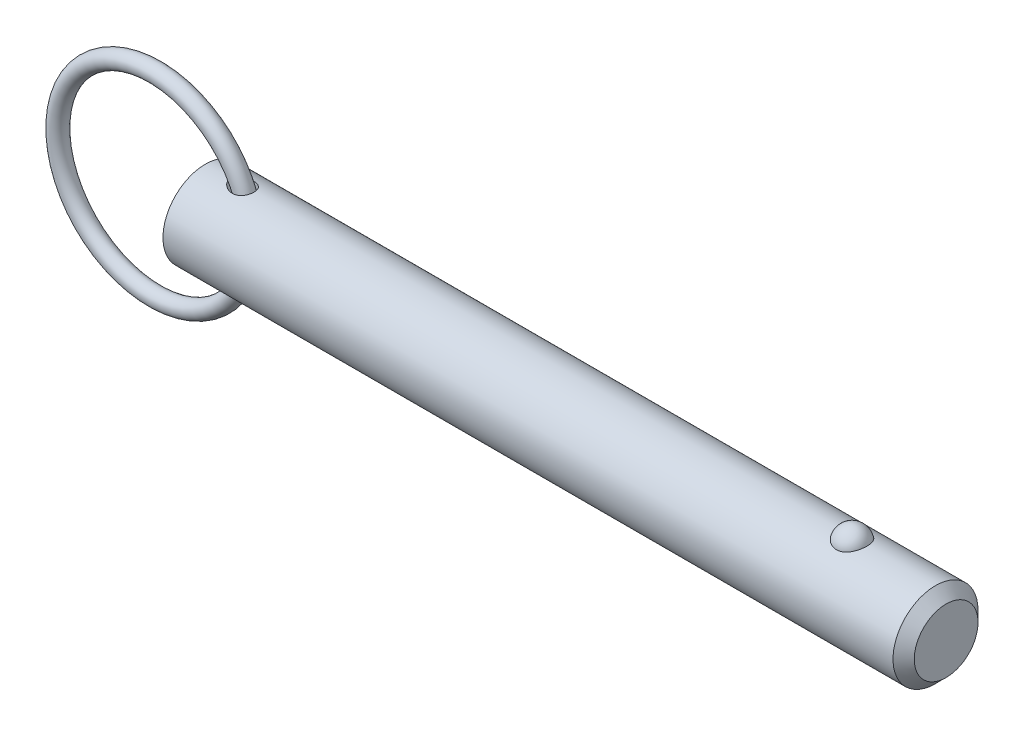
ISO-10303-21;
HEADER;
FILE_DESCRIPTION(('STEP AP214'),'2;1');
FILE_NAME('part.step','',(''),(''),'','','');
FILE_SCHEMA(('AUTOMOTIVE_DESIGN { 1 0 10303 214 1 1 1 1 }'));
ENDSEC;
DATA;
#1=APPLICATION_CONTEXT('core data for automotive mechanical design processes');
#2=APPLICATION_PROTOCOL_DEFINITION('international standard','automotive_design',2000,#1);
#3=PRODUCT_CONTEXT('',#1,'mechanical');
#4=PRODUCT('Part','Part','',(#3));
#5=PRODUCT_RELATED_PRODUCT_CATEGORY('part','',(#4));
#6=PRODUCT_DEFINITION_FORMATION('','',#4);
#7=PRODUCT_DEFINITION_CONTEXT('part definition',#1,'design');
#8=PRODUCT_DEFINITION('design','',#6,#7);
#9=PRODUCT_DEFINITION_SHAPE('','',#8);
#10=(LENGTH_UNIT() NAMED_UNIT(*) SI_UNIT(.MILLI.,.METRE.));
#11=(NAMED_UNIT(*) PLANE_ANGLE_UNIT() SI_UNIT($,.RADIAN.));
#12=(NAMED_UNIT(*) SI_UNIT($,.STERADIAN.) SOLID_ANGLE_UNIT());
#13=UNCERTAINTY_MEASURE_WITH_UNIT(LENGTH_MEASURE(1.E-05),#10,'distance_accuracy_value','');
#14=(GEOMETRIC_REPRESENTATION_CONTEXT(3) GLOBAL_UNCERTAINTY_ASSIGNED_CONTEXT((#13)) GLOBAL_UNIT_ASSIGNED_CONTEXT((#10,
#11,#12)) REPRESENTATION_CONTEXT('',''));
#15=CARTESIAN_POINT('',(0.,0.,0.));
#16=DIRECTION('',(0.,0.,1.));
#17=DIRECTION('',(1.,0.,0.));
#18=AXIS2_PLACEMENT_3D('',#15,#16,#17);
#19=CARTESIAN_POINT('',(-6.5973878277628,0.,0.));
#20=DIRECTION('',(0.,0.,1.));
#21=DIRECTION('',(1.,0.,0.));
#22=AXIS2_PLACEMENT_3D('',#19,#20,#21);
#23=TOROIDAL_SURFACE('',#22,12.7,1.111);
#24=CARTESIAN_POINT('',(7.21361217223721,0.,0.));
#25=VERTEX_POINT('',#24);
#26=VERTEX_LOOP('',#25);
#27=FACE_BOUND('',#26,.T.);
#28=ADVANCED_FACE('P0_F12',(#27),#23,.T.);
#29=CLOSED_SHELL('',(#28));
#30=MANIFOLD_SOLID_BREP('P0_B1',#29);
#31=CARTESIAN_POINT('',(0.,0.,0.));
#32=DIRECTION('',(1.,0.,0.));
#33=DIRECTION('',(0.,0.,-1.));
#34=AXIS2_PLACEMENT_3D('',#31,#32,#33);
#35=CYLINDRICAL_SURFACE('',#34,5.555);
#36=CARTESIAN_POINT('',(3.4079629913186,5.52646850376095,-0.56229074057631));
#37=CARTESIAN_POINT('',(3.45038002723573,5.51879026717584,-0.637753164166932));
#38=CARTESIAN_POINT('',(3.50032814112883,5.50998541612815,-0.70889136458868));
#39=CARTESIAN_POINT('',(3.61174203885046,5.49132550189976,-0.841353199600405));
#40=CARTESIAN_POINT('',(3.67323300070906,5.48146816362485,-0.902654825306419));
#41=CARTESIAN_POINT('',(3.80437942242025,5.46186986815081,-1.01449227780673));
#42=CARTESIAN_POINT('',(3.87396236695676,5.45212862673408,-1.06511378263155));
#43=CARTESIAN_POINT('',(4.01965973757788,5.43359578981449,-1.15594541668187));
#44=CARTESIAN_POINT('',(4.09577226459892,5.42480391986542,-1.19615855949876));
#45=CARTESIAN_POINT('',(4.26620236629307,5.40764958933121,-1.27165209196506));
#46=CARTESIAN_POINT('',(4.36143030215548,5.3996073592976,-1.30496908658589));
#47=CARTESIAN_POINT('',(4.55632904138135,5.38707461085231,-1.35578120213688));
#48=CARTESIAN_POINT('',(4.65600230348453,5.38258608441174,-1.37326745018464));
#49=CARTESIAN_POINT('',(4.85802759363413,5.37803111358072,-1.3910078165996));
#50=CARTESIAN_POINT('',(4.96039620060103,5.37800782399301,-1.39109376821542));
#51=CARTESIAN_POINT('',(5.16321961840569,5.38288845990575,-1.37209481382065));
#52=CARTESIAN_POINT('',(5.26367660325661,5.38778639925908,-1.3530331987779));
#53=CARTESIAN_POINT('',(5.44616808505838,5.40112654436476,-1.29866014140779));
#54=CARTESIAN_POINT('',(5.52893514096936,5.40904875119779,-1.26567968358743));
#55=CARTESIAN_POINT('',(5.68656142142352,5.4273273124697,-1.18484144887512));
#56=CARTESIAN_POINT('',(5.76142575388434,5.43768208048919,-1.13699336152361));
#57=CARTESIAN_POINT('',(5.8928378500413,5.45821422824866,-1.03362464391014));
#58=CARTESIAN_POINT('',(5.95048930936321,5.4682911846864,-0.979480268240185));
#59=CARTESIAN_POINT('',(6.05543937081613,5.48805232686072,-0.861887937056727));
#60=CARTESIAN_POINT('',(6.10274018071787,5.4977365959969,-0.798441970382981));
#61=CARTESIAN_POINT('',(6.18429732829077,5.51527779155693,-0.666351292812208));
#62=CARTESIAN_POINT('',(6.21893047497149,5.52318421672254,-0.597945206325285));
#63=CARTESIAN_POINT('',(6.27643902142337,5.53669785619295,-0.456146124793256));
#64=CARTESIAN_POINT('',(6.299314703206,5.54230512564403,-0.382753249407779));
#65=CARTESIAN_POINT('',(6.33280284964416,5.55061821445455,-0.232999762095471));
#66=CARTESIAN_POINT('',(6.34340498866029,5.55332159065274,-0.156636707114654));
#67=CARTESIAN_POINT('',(6.35208224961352,5.55552923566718,-0.00315477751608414));
#68=CARTESIAN_POINT('',(6.3501570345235,5.55503341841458,0.0739641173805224));
#69=CARTESIAN_POINT('',(6.33379320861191,5.55088854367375,0.22702996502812));
#70=CARTESIAN_POINT('',(6.31931424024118,5.54722931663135,0.302972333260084));
#71=CARTESIAN_POINT('',(6.27810810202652,5.53713917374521,0.451265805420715));
#72=CARTESIAN_POINT('',(6.25138106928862,5.53070828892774,0.523616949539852));
#73=CARTESIAN_POINT('',(6.18634700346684,5.51578851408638,0.662556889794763));
#74=CARTESIAN_POINT('',(6.14805666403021,5.50730259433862,0.729153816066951));
#75=CARTESIAN_POINT('',(6.0608417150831,5.4892059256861,0.854797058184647));
#76=CARTESIAN_POINT('',(6.01191805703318,5.47959527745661,0.91384404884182));
#77=CARTESIAN_POINT('',(5.90496974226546,5.46035411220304,1.0225462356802));
#78=CARTESIAN_POINT('',(5.8469816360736,5.45072382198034,1.07223745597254));
#79=CARTESIAN_POINT('',(5.72342907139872,5.43245016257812,1.16128533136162));
#80=CARTESIAN_POINT('',(5.65786492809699,5.42380675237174,1.20064241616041));
#81=CARTESIAN_POINT('',(5.52033184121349,5.40830592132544,1.26865612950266));
#82=CARTESIAN_POINT('',(5.44830127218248,5.40146883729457,1.29719236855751));
#83=CARTESIAN_POINT('',(5.30051649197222,5.39032432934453,1.34275086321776));
#84=CARTESIAN_POINT('',(5.22476137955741,5.38601752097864,1.35977031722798));
#85=CARTESIAN_POINT('',(5.06697568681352,5.38004503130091,1.3832203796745));
#86=CARTESIAN_POINT('',(4.98483834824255,5.37854992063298,1.38896799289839));
#87=CARTESIAN_POINT('',(4.82062075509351,5.37866467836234,1.38851901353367));
#88=CARTESIAN_POINT('',(4.73854053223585,5.38027567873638,1.38231806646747));
#89=CARTESIAN_POINT('',(4.5665970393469,5.38661928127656,1.35740374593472));
#90=CARTESIAN_POINT('',(4.47694676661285,5.39169506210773,1.33731128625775));
#91=CARTESIAN_POINT('',(4.30168169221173,5.40457769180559,1.28425210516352));
#92=CARTESIAN_POINT('',(4.2160714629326,5.41238755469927,1.25127117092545));
#93=CARTESIAN_POINT('',(4.04117722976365,5.43085841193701,1.16867508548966));
#94=CARTESIAN_POINT('',(3.95261220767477,5.44174460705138,1.11757796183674));
#95=CARTESIAN_POINT('',(3.78568183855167,5.46440376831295,1.00091858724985));
#96=CARTESIAN_POINT('',(3.70730710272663,5.47617590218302,0.935369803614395));
#97=CARTESIAN_POINT('',(3.5829937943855,5.49603821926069,0.809043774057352));
#98=CARTESIAN_POINT('',(3.5339020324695,5.50429522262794,0.751392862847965));
#99=CARTESIAN_POINT('',(3.44556991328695,5.51963490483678,0.628847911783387));
#100=CARTESIAN_POINT('',(3.40631385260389,5.52671944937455,0.563965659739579));
#101=CARTESIAN_POINT('',(3.34553998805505,5.5379053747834,0.439181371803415));
#102=CARTESIAN_POINT('',(3.32216705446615,5.5423057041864,0.380214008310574));
#103=CARTESIAN_POINT('',(3.2854368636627,5.54928356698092,0.259119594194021));
#104=CARTESIAN_POINT('',(3.27207322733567,5.5518622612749,0.196994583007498));
#105=CARTESIAN_POINT('',(3.25633559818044,5.5549036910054,0.0710541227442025));
#106=CARTESIAN_POINT('',(3.25400356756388,5.5553583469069,0.00723314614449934));
#107=CARTESIAN_POINT('',(3.26064251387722,5.55407150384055,-0.119787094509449));
#108=CARTESIAN_POINT('',(3.26961302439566,5.55233009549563,-0.182986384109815));
#109=CARTESIAN_POINT('',(3.29666795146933,5.54714559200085,-0.30051820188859));
#110=CARTESIAN_POINT('',(3.31373453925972,5.54389322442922,-0.355099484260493));
#111=CARTESIAN_POINT('',(3.35543396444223,5.53607951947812,-0.461174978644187));
#112=CARTESIAN_POINT('',(3.38007019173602,5.5315175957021,-0.512667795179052));
#113=CARTESIAN_POINT('',(3.4079629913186,5.52646850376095,-0.56229074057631));
#114=B_SPLINE_CURVE_WITH_KNOTS('',3,(#36,#37,#38,#39,#40,#41,#42,#43,#44,#45,#46,#47,#48,#49,
#50,#51,#52,#53,#54,#55,#56,#57,#58,#59,#60,#61,#62,#63,#64,#65,#66,#67,#68,#69,#70,#71,#72,#73,
#74,#75,#76,#77,#78,#79,#80,#81,#82,#83,#84,#85,#86,#87,#88,#89,#90,#91,#92,#93,#94,#95,#96,#97,
#98,#99,#100,#101,#102,#103,#104,#105,#106,#107,#108,#109,#110,#111,#112,#113),.UNSPECIFIED.,
.T.,.F.,(4,2,2,2,2,2,2,2,2,2,2,2,2,2,2,2,2,2,2,2,2,2,2,2,2,2,2,2,2,2,2,2,2,2,2,2,2,2,4),(0.,
0.260459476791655,0.521493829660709,0.780346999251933,1.03912513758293,1.34137402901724,
1.64379222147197,1.94913302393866,2.25410286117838,2.52092363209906,2.78757087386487,
3.0255756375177,3.26352958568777,3.49368251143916,3.72382991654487,3.9541708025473,
4.18451788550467,4.41560824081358,4.64669600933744,4.87745174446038,5.10818684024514,
5.33801446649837,5.56783253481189,5.80013729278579,6.03249854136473,6.27855081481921,
6.5246927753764,6.79963372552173,7.07487872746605,7.38193573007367,7.68870779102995,
7.91639390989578,8.14371416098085,8.33366541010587,8.52349549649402,8.71404708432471,
8.90459080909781,9.07578823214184,9.24706243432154),.UNSPECIFIED.);
#115=CARTESIAN_POINT('',(3.4079629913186,5.52646850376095,-0.56229074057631));
#116=VERTEX_POINT('',#115);
#117=EDGE_CURVE('P1_E40',#116,#116,#114,.T.);
#118=ORIENTED_EDGE('',*,*,#117,.T.);
#119=EDGE_LOOP('',(#118));
#120=FACE_BOUND('',#119,.T.);
#121=CARTESIAN_POINT('',(95.43125,0.,0.));
#122=DIRECTION('',(1.,0.,0.));
#123=DIRECTION('',(0.,0.,-1.));
#124=AXIS2_PLACEMENT_3D('',#121,#122,#123);
#125=CIRCLE('',#124,5.555);
#126=CARTESIAN_POINT('',(95.43125,0.,-5.555));
#127=VERTEX_POINT('',#126);
#128=EDGE_CURVE('P1_E25',#127,#127,#125,.T.);
#129=ORIENTED_EDGE('',*,*,#128,.F.);
#130=EDGE_LOOP('',(#129));
#131=FACE_BOUND('',#130,.T.);
#132=CARTESIAN_POINT('',(0.,0.,0.));
#133=DIRECTION('',(1.,0.,0.));
#134=DIRECTION('',(0.,0.,-1.));
#135=AXIS2_PLACEMENT_3D('',#132,#133,#134);
#136=CIRCLE('',#135,5.555);
#137=CARTESIAN_POINT('',(0.,0.,-5.555));
#138=VERTEX_POINT('',#137);
#139=EDGE_CURVE('P1_E9',#138,#138,#136,.T.);
#140=ORIENTED_EDGE('',*,*,#139,.T.);
#141=EDGE_LOOP('',(#140));
#142=FACE_BOUND('',#141,.T.);
#143=CARTESIAN_POINT('',(84.5186264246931,5.16741224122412,2.03859650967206));
#144=CARTESIAN_POINT('',(84.4129492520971,5.16740893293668,2.03859990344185));
#145=CARTESIAN_POINT('',(84.3072989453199,5.17079470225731,2.03008306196));
#146=CARTESIAN_POINT('',(84.0991419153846,5.18392795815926,1.99630721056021));
#147=CARTESIAN_POINT('',(83.9966344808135,5.19367399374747,1.97105201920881));
#148=CARTESIAN_POINT('',(83.7977710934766,5.21839168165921,1.90463997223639));
#149=CARTESIAN_POINT('',(83.7014064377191,5.23335573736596,1.86350622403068));
#150=CARTESIAN_POINT('',(83.5170804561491,5.26688076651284,1.76652592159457));
#151=CARTESIAN_POINT('',(83.4291207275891,5.28544242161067,1.71067657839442));
#152=CARTESIAN_POINT('',(83.261265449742,5.32479845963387,1.58399959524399));
#153=CARTESIAN_POINT('',(83.1816656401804,5.34564089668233,1.51279545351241));
#154=CARTESIAN_POINT('',(83.0351290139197,5.38697258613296,1.35828584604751));
#155=CARTESIAN_POINT('',(82.968194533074,5.40746177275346,1.27497815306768));
#156=CARTESIAN_POINT('',(82.8456103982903,5.44694508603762,1.09440293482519));
#157=CARTESIAN_POINT('',(82.7905989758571,5.46583143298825,0.996677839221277));
#158=CARTESIAN_POINT('',(82.6969376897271,5.49908030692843,0.79296193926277));
#159=CARTESIAN_POINT('',(82.6582894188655,5.513442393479,0.686970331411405));
#160=CARTESIAN_POINT('',(82.5976807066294,5.536358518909,0.468019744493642));
#161=CARTESIAN_POINT('',(82.5759725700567,5.54482455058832,0.354981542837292));
#162=CARTESIAN_POINT('',(82.5506362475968,5.55473324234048,0.126595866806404));
#163=CARTESIAN_POINT('',(82.5470077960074,5.55617600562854,0.0112484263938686));
#164=CARTESIAN_POINT('',(82.5578817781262,5.55189984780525,-0.218011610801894));
#165=CARTESIAN_POINT('',(82.5723151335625,5.54620821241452,-0.331928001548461));
#166=CARTESIAN_POINT('',(82.618903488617,5.52828920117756,-0.555544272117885));
#167=CARTESIAN_POINT('',(82.6510588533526,5.5160616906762,-0.66524406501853));
#168=CARTESIAN_POINT('',(82.7324883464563,5.48630779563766,-0.877469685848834));
#169=CARTESIAN_POINT('',(82.781781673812,5.4687754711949,-0.979987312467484));
#170=CARTESIAN_POINT('',(82.8964785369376,5.43024700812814,-1.17486975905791));
#171=CARTESIAN_POINT('',(82.9618831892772,5.4092506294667,-1.26723387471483));
#172=CARTESIAN_POINT('',(83.1075712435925,5.36600927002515,-1.43940133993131));
#173=CARTESIAN_POINT('',(83.1878859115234,5.34376173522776,-1.51917763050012));
#174=CARTESIAN_POINT('',(83.3614520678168,5.30057971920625,-1.66360338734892));
#175=CARTESIAN_POINT('',(83.454702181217,5.27964509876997,-1.72825445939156));
#176=CARTESIAN_POINT('',(83.6493939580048,5.24205250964,-1.83909478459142));
#177=CARTESIAN_POINT('',(83.7505900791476,5.22530519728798,-1.88568407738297));
#178=CARTESIAN_POINT('',(83.9601552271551,5.19750919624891,-1.96100802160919));
#179=CARTESIAN_POINT('',(84.0685215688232,5.1864583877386,-1.98974931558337));
#180=CARTESIAN_POINT('',(84.2834989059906,5.17184410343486,-2.02742262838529));
#181=CARTESIAN_POINT('',(84.389925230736,5.1679328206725,-2.03727608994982));
#182=CARTESIAN_POINT('',(84.6029925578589,5.16698995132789,-2.03966777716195));
#183=CARTESIAN_POINT('',(84.7096335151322,5.16995704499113,-2.03220932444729));
#184=CARTESIAN_POINT('',(84.9167730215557,5.18222383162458,-2.00071170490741));
#185=CARTESIAN_POINT('',(85.0173599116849,5.19133213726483,-1.97717337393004));
#186=CARTESIAN_POINT('',(85.2130141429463,5.21467637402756,-1.91475248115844));
#187=CARTESIAN_POINT('',(85.3080810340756,5.22891272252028,-1.87586867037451));
#188=CARTESIAN_POINT('',(85.4923711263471,5.26137066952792,-1.7828271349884));
#189=CARTESIAN_POINT('',(85.5814190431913,5.27967329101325,-1.72835124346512));
#190=CARTESIAN_POINT('',(85.7492880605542,5.31817411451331,-1.6059748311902));
#191=CARTESIAN_POINT('',(85.8281068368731,5.33837274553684,-1.53807126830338));
#192=CARTESIAN_POINT('',(85.9775156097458,5.37968287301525,-1.38688970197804));
#193=CARTESIAN_POINT('',(86.0475058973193,5.40079011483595,-1.30301744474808));
#194=CARTESIAN_POINT('',(86.1730125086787,5.44074401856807,-1.12458170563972));
#195=CARTESIAN_POINT('',(86.2285262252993,5.4595902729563,-1.03001630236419));
#196=CARTESIAN_POINT('',(86.3255507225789,5.49369849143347,-0.829439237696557));
#197=CARTESIAN_POINT('',(86.3665483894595,5.50882422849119,-0.723155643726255));
#198=CARTESIAN_POINT('',(86.4311250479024,5.53310911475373,-0.504772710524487));
#199=CARTESIAN_POINT('',(86.4547036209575,5.54226812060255,-0.392673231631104));
#200=CARTESIAN_POINT('',(86.484013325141,5.55370358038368,-0.165459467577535));
#201=CARTESIAN_POINT('',(86.4896884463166,5.55595843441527,-0.0503368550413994));
#202=CARTESIAN_POINT('',(86.482916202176,5.55329317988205,0.179288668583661));
#203=CARTESIAN_POINT('',(86.4704690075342,5.54837313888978,0.29379158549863));
#204=CARTESIAN_POINT('',(86.4277798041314,5.53189037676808,0.51852641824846));
#205=CARTESIAN_POINT('',(86.397598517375,5.5203503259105,0.628771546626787));
#206=CARTESIAN_POINT('',(86.3200962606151,5.49182453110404,0.842318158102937));
#207=CARTESIAN_POINT('',(86.2727743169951,5.47483847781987,0.945619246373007));
#208=CARTESIAN_POINT('',(86.1617204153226,5.43710633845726,1.14281571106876));
#209=CARTESIAN_POINT('',(86.0979215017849,5.41634501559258,1.23667048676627));
#210=CARTESIAN_POINT('',(85.9553577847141,5.37334572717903,1.41185243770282));
#211=CARTESIAN_POINT('',(85.8765932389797,5.35110778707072,1.4931798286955));
#212=CARTESIAN_POINT('',(85.7064234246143,5.30779474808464,1.64049162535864));
#213=CARTESIAN_POINT('',(85.6151002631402,5.28671324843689,1.70656877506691));
#214=CARTESIAN_POINT('',(85.4217390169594,5.24804852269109,1.82201372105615));
#215=CARTESIAN_POINT('',(85.3197005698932,5.23046541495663,1.87138095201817));
#216=CARTESIAN_POINT('',(85.1036187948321,5.20042692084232,1.95335298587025));
#217=CARTESIAN_POINT('',(84.989260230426,5.18820192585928,1.98521734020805));
#218=CARTESIAN_POINT('',(84.7561307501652,5.17169804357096,2.02783294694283));
#219=CARTESIAN_POINT('',(84.6373616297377,5.16741595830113,2.03859269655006));
#220=CARTESIAN_POINT('',(84.5186264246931,5.16741224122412,2.03859650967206));
#221=B_SPLINE_CURVE_WITH_KNOTS('',3,(#143,#144,#145,#146,#147,#148,#149,#150,#151,#152,#153,
#154,#155,#156,#157,#158,#159,#160,#161,#162,#163,#164,#165,#166,#167,#168,#169,#170,#171,#172,
#173,#174,#175,#176,#177,#178,#179,#180,#181,#182,#183,#184,#185,#186,#187,#188,#189,#190,#191,
#192,#193,#194,#195,#196,#197,#198,#199,#200,#201,#202,#203,#204,#205,#206,#207,#208,#209,#210,
#211,#212,#213,#214,#215,#216,#217,#218,#219,#220),.UNSPECIFIED.,.T.,.F.,(4,2,2,2,2,2,2,2,2,2,2,
2,2,2,2,2,2,2,2,2,2,2,2,2,2,2,2,2,2,2,2,2,2,2,2,2,2,2,4),(0.,0.316595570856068,
0.633118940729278,0.949183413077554,1.26530783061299,1.59030762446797,1.91536729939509,
2.25495824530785,2.59458224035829,2.93917283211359,3.28375835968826,3.62703002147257,
3.97030875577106,4.31397329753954,4.65766166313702,5.0020790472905,5.34645984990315,
5.68270547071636,6.01882587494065,6.33808403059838,6.65728093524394,6.96696376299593,
7.27667180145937,7.59321535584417,7.909830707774,8.24210387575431,8.57443684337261,
8.91755896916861,9.26068933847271,9.60489211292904,9.94909164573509,10.2921194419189,
10.6351667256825,10.9796305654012,11.3240884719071,11.6663928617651,12.0087088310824,
12.3645679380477,12.7202837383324),.UNSPECIFIED.);
#222=CARTESIAN_POINT('',(84.5186264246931,5.16741224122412,2.03859650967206));
#223=VERTEX_POINT('',#222);
#224=EDGE_CURVE('P1_E34',#223,#223,#221,.T.);
#225=ORIENTED_EDGE('',*,*,#224,.T.);
#226=EDGE_LOOP('',(#225));
#227=FACE_BOUND('',#226,.T.);
#228=CARTESIAN_POINT('',(3.4079629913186,-5.52646850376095,-0.56229074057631));
#229=CARTESIAN_POINT('',(3.37716927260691,-5.53204268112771,-0.507507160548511));
#230=CARTESIAN_POINT('',(3.35034276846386,-5.53702335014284,-0.450440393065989));
#231=CARTESIAN_POINT('',(3.30606625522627,-5.54534377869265,-0.3326552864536));
#232=CARTESIAN_POINT('',(3.28860803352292,-5.5486849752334,-0.271940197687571));
#233=CARTESIAN_POINT('',(3.26421203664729,-5.55337514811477,-0.148013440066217));
#234=CARTESIAN_POINT('',(3.25732647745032,-5.55471423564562,-0.0847909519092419));
#235=CARTESIAN_POINT('',(3.25480623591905,-5.5552029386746,0.0418913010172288));
#236=CARTESIAN_POINT('',(3.25917102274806,-5.55435265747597,0.105351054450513));
#237=CARTESIAN_POINT('',(3.27824306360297,-5.55067444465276,0.227039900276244));
#238=CARTESIAN_POINT('',(3.29237198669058,-5.54795714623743,0.285365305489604));
#239=CARTESIAN_POINT('',(3.32941044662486,-5.54094262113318,0.399033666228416));
#240=CARTESIAN_POINT('',(3.3523223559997,-5.53664496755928,0.454375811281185));
#241=CARTESIAN_POINT('',(3.40768868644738,-5.52648234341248,0.56509977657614));
#242=CARTESIAN_POINT('',(3.44072521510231,-5.52052470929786,0.620179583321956));
#243=CARTESIAN_POINT('',(3.51400705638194,-5.50771567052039,0.725188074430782));
#244=CARTESIAN_POINT('',(3.55425830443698,-5.50086353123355,0.775112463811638));
#245=CARTESIAN_POINT('',(3.66122818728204,-5.48337209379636,0.891977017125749));
#246=CARTESIAN_POINT('',(3.73142715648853,-5.47248221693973,0.955709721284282));
#247=CARTESIAN_POINT('',(3.88137100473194,-5.45112279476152,1.07085228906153));
#248=CARTESIAN_POINT('',(3.96113047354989,-5.44065392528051,1.12224294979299));
#249=CARTESIAN_POINT('',(4.12858826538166,-5.42121387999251,1.21269344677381));
#250=CARTESIAN_POINT('',(4.21635930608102,-5.41225908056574,1.25162207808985));
#251=CARTESIAN_POINT('',(4.39702156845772,-5.39704895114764,1.31566440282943));
#252=CARTESIAN_POINT('',(4.48991226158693,-5.39079334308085,1.34077951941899));
#253=CARTESIAN_POINT('',(4.68604255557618,-5.38154547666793,1.37745897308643));
#254=CARTESIAN_POINT('',(4.78952677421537,-5.37884317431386,1.38782444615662));
#255=CARTESIAN_POINT('',(4.9967070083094,-5.3783992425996,1.38955482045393));
#256=CARTESIAN_POINT('',(5.10040282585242,-5.380654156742,1.380932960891));
#257=CARTESIAN_POINT('',(5.29344112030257,-5.3896561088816,1.34533259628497));
#258=CARTESIAN_POINT('',(5.38316618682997,-5.39591960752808,1.32032381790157));
#259=CARTESIAN_POINT('',(5.55593681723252,-5.41176992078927,1.25376768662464));
#260=CARTESIAN_POINT('',(5.63898852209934,-5.42135363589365,1.2122357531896));
#261=CARTESIAN_POINT('',(5.78518175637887,-5.4411584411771,1.1197110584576));
#262=CARTESIAN_POINT('',(5.84951468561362,-5.45115126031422,1.07054233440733));
#263=CARTESIAN_POINT('',(5.96832363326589,-5.47143247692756,0.961516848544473));
#264=CARTESIAN_POINT('',(6.02280238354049,-5.48172079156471,0.901663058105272));
#265=CARTESIAN_POINT('',(6.11773365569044,-5.50082367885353,0.776380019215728));
#266=CARTESIAN_POINT('',(6.15876077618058,-5.50968670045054,0.711392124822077));
#267=CARTESIAN_POINT('',(6.22940016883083,-5.52555592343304,0.575278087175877));
#268=CARTESIAN_POINT('',(6.25901321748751,-5.53256225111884,0.504152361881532));
#269=CARTESIAN_POINT('',(6.30603044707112,-5.54392803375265,0.358090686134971));
#270=CARTESIAN_POINT('',(6.32348246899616,-5.54829785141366,0.283170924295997));
#271=CARTESIAN_POINT('',(6.34598368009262,-5.5539654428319,0.131376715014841));
#272=CARTESIAN_POINT('',(6.35103253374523,-5.55526313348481,0.054502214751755));
#273=CARTESIAN_POINT('',(6.34861245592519,-5.55464639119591,-0.0993401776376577));
#274=CARTESIAN_POINT('',(6.34109421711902,-5.5527193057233,-0.176307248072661));
#275=CARTESIAN_POINT('',(6.31360904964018,-5.54583593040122,-0.327847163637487));
#276=CARTESIAN_POINT('',(6.29364207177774,-5.54087962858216,-0.402419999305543));
#277=CARTESIAN_POINT('',(6.24170966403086,-5.52847553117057,-0.547041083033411));
#278=CARTESIAN_POINT('',(6.20974488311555,-5.52102787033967,-0.617089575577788));
#279=CARTESIAN_POINT('',(6.13458425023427,-5.5044595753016,-0.750655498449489));
#280=CARTESIAN_POINT('',(6.09138916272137,-5.49533905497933,-0.814173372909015));
#281=CARTESIAN_POINT('',(5.99508306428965,-5.47647644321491,-0.932642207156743));
#282=CARTESIAN_POINT('',(5.94201288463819,-5.46673701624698,-0.987626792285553));
#283=CARTESIAN_POINT('',(5.82732079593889,-5.4476756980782,-1.08787197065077));
#284=CARTESIAN_POINT('',(5.76569959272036,-5.43835377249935,-1.133133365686));
#285=CARTESIAN_POINT('',(5.63545565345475,-5.42108746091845,-1.2130627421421));
#286=CARTESIAN_POINT('',(5.56680798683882,-5.41314827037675,-1.24769112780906));
#287=CARTESIAN_POINT('',(5.42470366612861,-5.39946749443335,-1.30562834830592));
#288=CARTESIAN_POINT('',(5.35124627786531,-5.39372624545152,-1.32893545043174));
#289=CARTESIAN_POINT('',(5.19834649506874,-5.38471871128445,-1.36498831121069));
#290=CARTESIAN_POINT('',(5.11878242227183,-5.38156800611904,-1.37724301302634));
#291=CARTESIAN_POINT('',(4.95867408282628,-5.37830368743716,-1.38993264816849));
#292=CARTESIAN_POINT('',(4.87812945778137,-5.37819121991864,-1.39036312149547));
#293=CARTESIAN_POINT('',(4.70952450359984,-5.38096665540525,-1.37958681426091));
#294=CARTESIAN_POINT('',(4.62154757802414,-5.38416579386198,-1.36717293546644));
#295=CARTESIAN_POINT('',(4.44844201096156,-5.39350862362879,-1.32983172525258));
#296=CARTESIAN_POINT('',(4.36331534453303,-5.39965431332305,-1.30489590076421));
#297=CARTESIAN_POINT('',(4.18705584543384,-5.41508127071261,-1.23943340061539));
#298=CARTESIAN_POINT('',(4.09653169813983,-5.42466147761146,-1.19732979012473));
#299=CARTESIAN_POINT('',(3.92355621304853,-5.44542654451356,-1.09903394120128));
#300=CARTESIAN_POINT('',(3.84111059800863,-5.45661252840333,-1.04283181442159));
#301=CARTESIAN_POINT('',(3.69303712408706,-5.47835672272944,-0.921492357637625));
#302=CARTESIAN_POINT('',(3.62661543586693,-5.4888999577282,-0.857326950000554));
#303=CARTESIAN_POINT('',(3.50663841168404,-5.50887375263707,-0.717815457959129));
#304=CARTESIAN_POINT('',(3.45304856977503,-5.51830726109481,-0.642500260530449));
#305=CARTESIAN_POINT('',(3.4079629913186,-5.52646850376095,-0.56229074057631));
#306=B_SPLINE_CURVE_WITH_KNOTS('',3,(#228,#229,#230,#231,#232,#233,#234,#235,#236,#237,#238,
#239,#240,#241,#242,#243,#244,#245,#246,#247,#248,#249,#250,#251,#252,#253,#254,#255,#256,#257,
#258,#259,#260,#261,#262,#263,#264,#265,#266,#267,#268,#269,#270,#271,#272,#273,#274,#275,#276,
#277,#278,#279,#280,#281,#282,#283,#284,#285,#286,#287,#288,#289,#290,#291,#292,#293,#294,#295,
#296,#297,#298,#299,#300,#301,#302,#303,#304,#305),.UNSPECIFIED.,.T.,.F.,(4,2,2,2,2,2,2,2,2,2,2,
2,2,2,2,2,2,2,2,2,2,2,2,2,2,2,2,2,2,2,2,2,2,2,2,2,2,2,4),(0.,0.189054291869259,
0.377942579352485,0.567760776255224,0.757570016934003,0.937004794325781,1.11648807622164,
1.30929480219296,1.50226088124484,1.78704908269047,2.07227755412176,2.3604171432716,
2.64852704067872,2.95892962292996,3.26911584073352,3.5475451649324,3.82571526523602,
4.06921935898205,4.31265584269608,4.54364944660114,4.77462733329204,5.00469135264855,
5.23476159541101,5.46573664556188,5.69671260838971,5.92767607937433,6.15862383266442,
6.38863707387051,6.61863134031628,6.84947196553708,7.08034790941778,7.32103794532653,
7.56181876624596,7.82747997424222,8.09332161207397,8.39289891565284,8.69268692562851,
8.97023931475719,9.24703674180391),.UNSPECIFIED.);
#307=CARTESIAN_POINT('',(3.4079629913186,-5.52646850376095,-0.56229074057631));
#308=VERTEX_POINT('',#307);
#309=EDGE_CURVE('P1_E17',#308,#308,#306,.T.);
#310=ORIENTED_EDGE('',*,*,#309,.T.);
#311=EDGE_LOOP('',(#310));
#312=FACE_BOUND('',#311,.T.);
#313=ADVANCED_FACE('P1_F13',(#120,#131,#142,#227,#312),#35,.T.);
#314=CARTESIAN_POINT('',(0.,0.,0.));
#315=DIRECTION('',(-1.,0.,0.));
#316=DIRECTION('',(0.,0.,1.));
#317=AXIS2_PLACEMENT_3D('',#314,#315,#316);
#318=PLANE('',#317);
#319=ORIENTED_EDGE('',*,*,#139,.F.);
#320=EDGE_LOOP('',(#319));
#321=FACE_BOUND('',#320,.T.);
#322=ADVANCED_FACE('P1_F15',(#321),#318,.T.);
#323=CARTESIAN_POINT('',(96.82,0.,0.));
#324=DIRECTION('',(-1.,0.,0.));
#325=DIRECTION('',(0.,0.,1.));
#326=AXIS2_PLACEMENT_3D('',#323,#324,#325);
#327=CONICAL_SURFACE('',#326,4.16625000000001,0.785398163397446);
#328=ORIENTED_EDGE('',*,*,#128,.T.);
#329=EDGE_LOOP('',(#328));
#330=FACE_BOUND('',#329,.T.);
#331=CARTESIAN_POINT('',(96.82,0.,0.));
#332=DIRECTION('',(1.,0.,0.));
#333=DIRECTION('',(0.,0.,-1.));
#334=AXIS2_PLACEMENT_3D('',#331,#332,#333);
#335=CIRCLE('',#334,4.16625000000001);
#336=CARTESIAN_POINT('',(96.82,0.,-4.16625000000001));
#337=VERTEX_POINT('',#336);
#338=EDGE_CURVE('P1_E30',#337,#337,#335,.T.);
#339=ORIENTED_EDGE('',*,*,#338,.F.);
#340=EDGE_LOOP('',(#339));
#341=FACE_BOUND('',#340,.T.);
#342=ADVANCED_FACE('P1_F55',(#330,#341),#327,.T.);
#343=CARTESIAN_POINT('',(96.82,4.16625000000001,0.));
#344=DIRECTION('',(1.,0.,0.));
#345=DIRECTION('',(0.,0.,-1.));
#346=AXIS2_PLACEMENT_3D('',#343,#344,#345);
#347=PLANE('',#346);
#348=ORIENTED_EDGE('',*,*,#338,.T.);
#349=EDGE_LOOP('',(#348));
#350=FACE_BOUND('',#349,.T.);
#351=ADVANCED_FACE('P1_F51',(#350),#347,.T.);
#352=CARTESIAN_POINT('',(84.5186264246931,4.9995,0.));
#353=DIRECTION('',(-1.,0.,0.));
#354=DIRECTION('',(0.,1.,0.));
#355=AXIS2_PLACEMENT_3D('',#352,#353,#354);
#356=SPHERICAL_SURFACE('',#355,2.04550000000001);
#357=ORIENTED_EDGE('',*,*,#224,.F.);
#358=EDGE_LOOP('',(#357));
#359=FACE_BOUND('',#358,.T.);
#360=ADVANCED_FACE('P1_F46',(#359),#356,.T.);
#361=CARTESIAN_POINT('',(-6.59738782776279,0.,0.));
#362=DIRECTION('',(0.,0.,1.));
#363=DIRECTION('',(1.,0.,0.));
#364=AXIS2_PLACEMENT_3D('',#361,#362,#363);
#365=TOROIDAL_SURFACE('',#364,12.7,1.38875);
#366=ORIENTED_EDGE('',*,*,#309,.F.);
#367=EDGE_LOOP('',(#366));
#368=FACE_BOUND('',#367,.T.);
#369=ORIENTED_EDGE('',*,*,#117,.F.);
#370=EDGE_LOOP('',(#369));
#371=FACE_BOUND('',#370,.T.);
#372=ADVANCED_FACE('P1_F50',(#368,#371),#365,.F.);
#373=CLOSED_SHELL('',(#313,#322,#342,#351,#360,#372));
#374=MANIFOLD_SOLID_BREP('P1_B1',#373);
#375=ADVANCED_BREP_SHAPE_REPRESENTATION('',(#18,#30,#374),#14);
#376=SHAPE_DEFINITION_REPRESENTATION(#9,#375);
ENDSEC;
END-ISO-10303-21;
